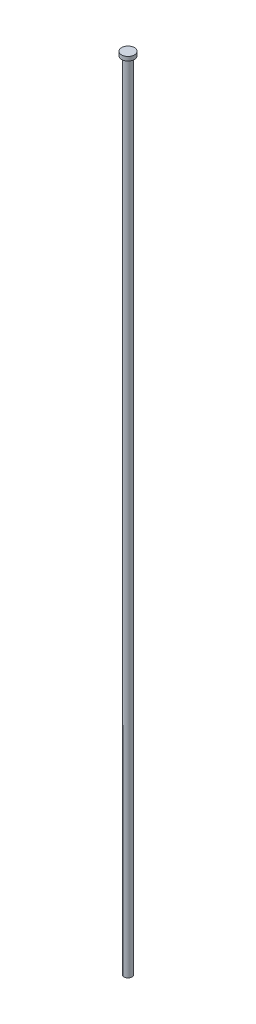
ISO-10303-21;
HEADER;
FILE_DESCRIPTION(('STEP AP214'),'2;1');
FILE_NAME('part.step','',(''),(''),'','','');
FILE_SCHEMA(('AUTOMOTIVE_DESIGN { 1 0 10303 214 1 1 1 1 }'));
ENDSEC;
DATA;
#1=APPLICATION_CONTEXT('core data for automotive mechanical design processes');
#2=APPLICATION_PROTOCOL_DEFINITION('international standard','automotive_design',2000,#1);
#3=PRODUCT_CONTEXT('',#1,'mechanical');
#4=PRODUCT('Part','Part','',(#3));
#5=PRODUCT_RELATED_PRODUCT_CATEGORY('part','',(#4));
#6=PRODUCT_DEFINITION_FORMATION('','',#4);
#7=PRODUCT_DEFINITION_CONTEXT('part definition',#1,'design');
#8=PRODUCT_DEFINITION('design','',#6,#7);
#9=PRODUCT_DEFINITION_SHAPE('','',#8);
#10=(LENGTH_UNIT() NAMED_UNIT(*) SI_UNIT(.MILLI.,.METRE.));
#11=(NAMED_UNIT(*) PLANE_ANGLE_UNIT() SI_UNIT($,.RADIAN.));
#12=(NAMED_UNIT(*) SI_UNIT($,.STERADIAN.) SOLID_ANGLE_UNIT());
#13=UNCERTAINTY_MEASURE_WITH_UNIT(LENGTH_MEASURE(1.E-05),#10,'distance_accuracy_value','');
#14=(GEOMETRIC_REPRESENTATION_CONTEXT(3) GLOBAL_UNCERTAINTY_ASSIGNED_CONTEXT((#13)) GLOBAL_UNIT_ASSIGNED_CONTEXT((#10,
#11,#12)) REPRESENTATION_CONTEXT('',''));
#15=CARTESIAN_POINT('',(0.,0.,0.));
#16=DIRECTION('',(0.,0.,1.));
#17=DIRECTION('',(1.,0.,0.));
#18=AXIS2_PLACEMENT_3D('',#15,#16,#17);
#19=CARTESIAN_POINT('',(0.,-1000.,0.));
#20=DIRECTION('',(0.,1.,0.));
#21=DIRECTION('',(0.,0.,1.));
#22=AXIS2_PLACEMENT_3D('',#19,#20,#21);
#23=CYLINDRICAL_SURFACE('',#22,5.);
#24=CARTESIAN_POINT('',(0.,-5.49999999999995,0.));
#25=DIRECTION('',(0.,1.,0.));
#26=DIRECTION('',(0.,0.,1.));
#27=AXIS2_PLACEMENT_3D('',#24,#25,#26);
#28=CIRCLE('',#27,5.);
#29=CARTESIAN_POINT('',(0.,-5.49999999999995,5.));
#30=VERTEX_POINT('',#29);
#31=EDGE_CURVE('E35',#30,#30,#28,.F.);
#32=ORIENTED_EDGE('',*,*,#31,.T.);
#33=EDGE_LOOP('',(#32));
#34=FACE_BOUND('',#33,.T.);
#35=CARTESIAN_POINT('',(0.,-1000.,0.));
#36=DIRECTION('',(0.,1.,0.));
#37=DIRECTION('',(0.,0.,1.));
#38=AXIS2_PLACEMENT_3D('',#35,#36,#37);
#39=CIRCLE('',#38,5.);
#40=CARTESIAN_POINT('',(0.,-1000.,5.));
#41=VERTEX_POINT('',#40);
#42=EDGE_CURVE('E39',#41,#41,#39,.T.);
#43=ORIENTED_EDGE('',*,*,#42,.T.);
#44=EDGE_LOOP('',(#43));
#45=FACE_BOUND('',#44,.T.);
#46=ADVANCED_FACE('F28',(#34,#45),#23,.T.);
#47=CARTESIAN_POINT('',(0.,-1000.,0.));
#48=DIRECTION('',(0.,1.,0.));
#49=DIRECTION('',(0.,0.,1.));
#50=AXIS2_PLACEMENT_3D('',#47,#48,#49);
#51=PLANE('',#50);
#52=ORIENTED_EDGE('',*,*,#42,.F.);
#53=EDGE_LOOP('',(#52));
#54=FACE_BOUND('',#53,.T.);
#55=ADVANCED_FACE('F65',(#54),#51,.F.);
#56=CARTESIAN_POINT('',(0.,-5.,0.));
#57=DIRECTION('',(0.,1.,0.));
#58=DIRECTION('',(0.,0.,1.));
#59=AXIS2_PLACEMENT_3D('',#56,#57,#58);
#60=CYLINDRICAL_SURFACE('',#59,8.);
#61=CARTESIAN_POINT('',(0.,-5.,0.));
#62=DIRECTION('',(0.,1.,0.));
#63=DIRECTION('',(0.,0.,1.));
#64=AXIS2_PLACEMENT_3D('',#61,#62,#63);
#65=CIRCLE('',#64,8.);
#66=CARTESIAN_POINT('',(0.,-5.,8.));
#67=VERTEX_POINT('',#66);
#68=EDGE_CURVE('E43',#67,#67,#65,.T.);
#69=ORIENTED_EDGE('',*,*,#68,.T.);
#70=EDGE_LOOP('',(#69));
#71=FACE_BOUND('',#70,.T.);
#72=CARTESIAN_POINT('',(0.,0.,0.));
#73=DIRECTION('',(0.,1.,0.));
#74=DIRECTION('',(0.,0.,1.));
#75=AXIS2_PLACEMENT_3D('',#72,#73,#74);
#76=CIRCLE('',#75,8.);
#77=CARTESIAN_POINT('',(0.,0.,8.));
#78=VERTEX_POINT('',#77);
#79=EDGE_CURVE('E46',#78,#78,#76,.T.);
#80=ORIENTED_EDGE('',*,*,#79,.F.);
#81=EDGE_LOOP('',(#80));
#82=FACE_BOUND('',#81,.T.);
#83=ADVANCED_FACE('F52',(#71,#82),#60,.T.);
#84=CARTESIAN_POINT('',(0.,-5.,0.));
#85=DIRECTION('',(0.,1.,0.));
#86=DIRECTION('',(0.,0.,1.));
#87=AXIS2_PLACEMENT_3D('',#84,#85,#86);
#88=PLANE('',#87);
#89=CARTESIAN_POINT('',(0.,-5.,0.));
#90=DIRECTION('',(0.,1.,0.));
#91=DIRECTION('',(0.,0.,1.));
#92=AXIS2_PLACEMENT_3D('',#89,#90,#91);
#93=CIRCLE('',#92,5.5);
#94=CARTESIAN_POINT('',(0.,-5.,5.5));
#95=VERTEX_POINT('',#94);
#96=EDGE_CURVE('E10',#95,#95,#93,.T.);
#97=ORIENTED_EDGE('',*,*,#96,.T.);
#98=EDGE_LOOP('',(#97));
#99=FACE_BOUND('',#98,.T.);
#100=ORIENTED_EDGE('',*,*,#68,.F.);
#101=EDGE_LOOP('',(#100));
#102=FACE_BOUND('',#101,.T.);
#103=ADVANCED_FACE('F55',(#99,#102),#88,.F.);
#104=CARTESIAN_POINT('',(0.,0.,0.));
#105=DIRECTION('',(0.,1.,0.));
#106=DIRECTION('',(0.,0.,1.));
#107=AXIS2_PLACEMENT_3D('',#104,#105,#106);
#108=PLANE('',#107);
#109=ORIENTED_EDGE('',*,*,#79,.T.);
#110=EDGE_LOOP('',(#109));
#111=FACE_BOUND('',#110,.T.);
#112=ADVANCED_FACE('F57',(#111),#108,.T.);
#113=CARTESIAN_POINT('',(0.,-5.49999999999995,0.));
#114=DIRECTION('',(0.,1.,0.));
#115=DIRECTION('',(0.,0.,1.));
#116=AXIS2_PLACEMENT_3D('',#113,#114,#115);
#117=TOROIDAL_SURFACE('',#116,5.5,0.5);
#118=ORIENTED_EDGE('',*,*,#96,.F.);
#119=EDGE_LOOP('',(#118));
#120=FACE_BOUND('',#119,.T.);
#121=ORIENTED_EDGE('',*,*,#31,.F.);
#122=EDGE_LOOP('',(#121));
#123=FACE_BOUND('',#122,.T.);
#124=ADVANCED_FACE('F30',(#120,#123),#117,.F.);
#125=CLOSED_SHELL('',(#46,#55,#83,#103,#112,#124));
#126=MANIFOLD_SOLID_BREP('B2',#125);
#127=ADVANCED_BREP_SHAPE_REPRESENTATION('',(#18,#126),#14);
#128=SHAPE_DEFINITION_REPRESENTATION(#9,#127);
ENDSEC;
END-ISO-10303-21;
